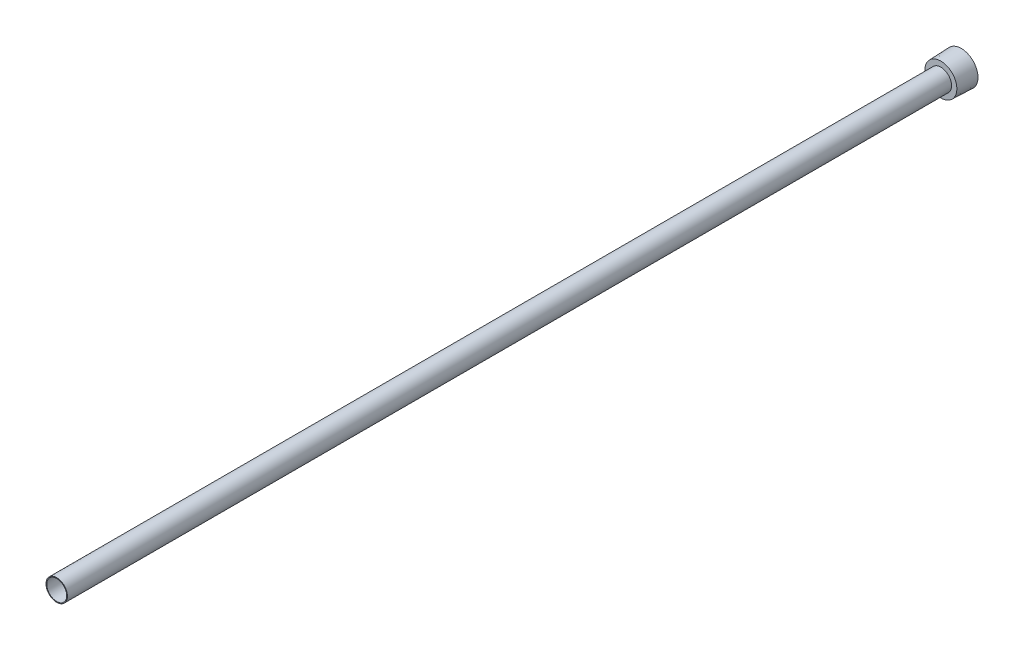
from build123d import *

# Parameters (mm, degrees)
SKETCH2_R          = 5.0419
CUT_EXTRUDE1_DEPTH = 458.356920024
CUT_EXTRUDE2_DEPTH = 6.35


with BuildPart() as part:
    # Sketch1 → Revolve1 (revolve)
    with BuildSketch(Plane(origin=(0, 0, 0), x_dir=(0, 0, -1), z_dir=(1, 0, 0)), mode=Mode.PRIVATE) as revolve1_sk:
        Polygon((0, 0), (0, 8.4709), (-10.3124, 8.094743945), (-10.3124, 5.4229), (-457.2, 5.4229), (-457.2, 0), align=None)
    revolve(revolve1_sk.sketch.rotate(Axis((0, 0, 168.793426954), (0, 0, -1)), 90), axis=Axis((0, 0, 168.793426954), (0, 0, -1)))

    # Sketch2 → Cut-Extrude1 (cut, through all)
    with BuildSketch(Plane.XY.offset(457.2)):
        Circle(SKETCH2_R)
    extrude(amount=-CUT_EXTRUDE1_DEPTH, mode=Mode.SUBTRACT)

    # Sketch3 → Cut-Extrude2 (cut)
    with BuildSketch(Plane(origin=(0, 0, 0), x_dir=(-1, 0, 0), z_dir=(0, 0, -1))):
        Polygon((0, -6.415804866), (5.55625, -3.207902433), (5.55625, 3.207902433), (0, 6.415804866), (-5.55625, 3.207902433), (-5.55625, -3.207902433), align=None)
    extrude(amount=-CUT_EXTRUDE2_DEPTH, mode=Mode.SUBTRACT)


solid = part.part
